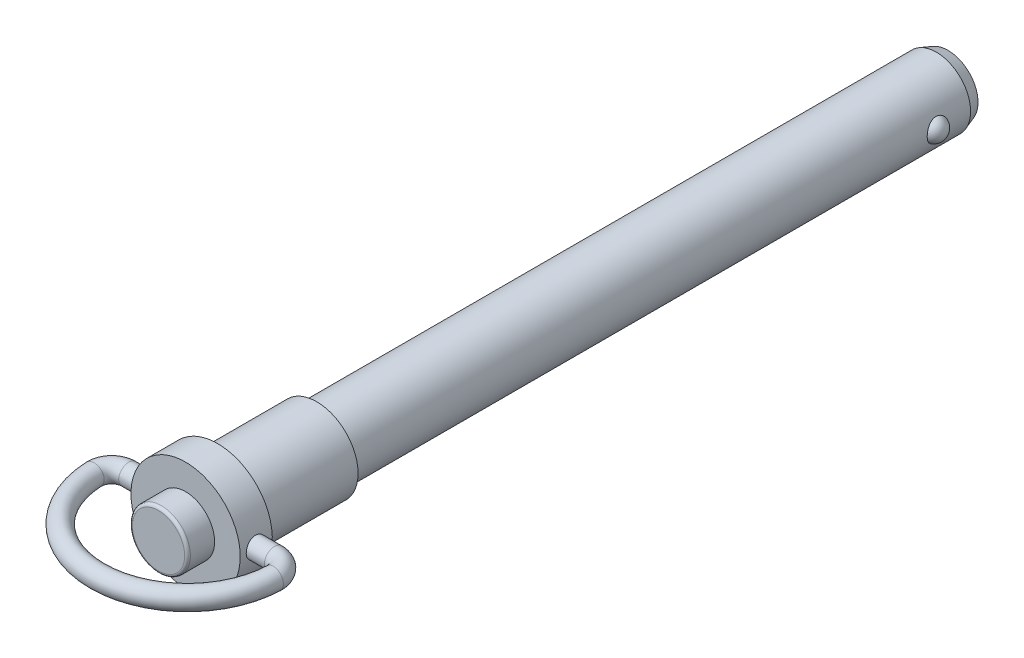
ISO-10303-21;
HEADER;
FILE_DESCRIPTION(('STEP AP214'),'2;1');
FILE_NAME('part.step','',(''),(''),'','','');
FILE_SCHEMA(('AUTOMOTIVE_DESIGN { 1 0 10303 214 1 1 1 1 }'));
ENDSEC;
DATA;
#1=APPLICATION_CONTEXT('core data for automotive mechanical design processes');
#2=APPLICATION_PROTOCOL_DEFINITION('international standard','automotive_design',2000,#1);
#3=PRODUCT_CONTEXT('',#1,'mechanical');
#4=PRODUCT('Part','Part','',(#3));
#5=PRODUCT_RELATED_PRODUCT_CATEGORY('part','',(#4));
#6=PRODUCT_DEFINITION_FORMATION('','',#4);
#7=PRODUCT_DEFINITION_CONTEXT('part definition',#1,'design');
#8=PRODUCT_DEFINITION('design','',#6,#7);
#9=PRODUCT_DEFINITION_SHAPE('','',#8);
#10=(LENGTH_UNIT() NAMED_UNIT(*) SI_UNIT(.MILLI.,.METRE.));
#11=(NAMED_UNIT(*) PLANE_ANGLE_UNIT() SI_UNIT($,.RADIAN.));
#12=(NAMED_UNIT(*) SI_UNIT($,.STERADIAN.) SOLID_ANGLE_UNIT());
#13=UNCERTAINTY_MEASURE_WITH_UNIT(LENGTH_MEASURE(1.E-05),#10,'distance_accuracy_value','');
#14=(GEOMETRIC_REPRESENTATION_CONTEXT(3) GLOBAL_UNCERTAINTY_ASSIGNED_CONTEXT((#13)) GLOBAL_UNIT_ASSIGNED_CONTEXT((#10,
#11,#12)) REPRESENTATION_CONTEXT('',''));
#15=CARTESIAN_POINT('',(0.,0.,0.));
#16=DIRECTION('',(0.,0.,1.));
#17=DIRECTION('',(1.,0.,0.));
#18=AXIS2_PLACEMENT_3D('',#15,#16,#17);
#19=CARTESIAN_POINT('',(-5.23004748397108,0.,-110.0304));
#20=DIRECTION('',(0.,0.,1.));
#21=DIRECTION('',(0.,1.,0.));
#22=AXIS2_PLACEMENT_3D('',#19,#20,#21);
#23=PLANE('',#22);
#24=CARTESIAN_POINT('',(0.,0.,-110.030399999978));
#25=DIRECTION('',(0.,0.,1.));
#26=DIRECTION('',(0.,1.,0.));
#27=AXIS2_PLACEMENT_3D('',#24,#25,#26);
#28=CIRCLE('',#27,5.23004748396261);
#29=CARTESIAN_POINT('',(0.,5.23004748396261,-110.030399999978));
#30=VERTEX_POINT('',#29);
#31=EDGE_CURVE('E117',#30,#30,#28,.T.);
#32=ORIENTED_EDGE('',*,*,#31,.F.);
#33=EDGE_LOOP('',(#32));
#34=FACE_BOUND('',#33,.T.);
#35=ADVANCED_FACE('F12',(#34),#23,.F.);
#36=CARTESIAN_POINT('',(-5.24129,0.,-102.2834));
#37=DIRECTION('',(0.,0.,1.));
#38=DIRECTION('',(-1.,0.,0.));
#39=AXIS2_PLACEMENT_3D('',#36,#37,#38);
#40=SPHERICAL_SURFACE('',#39,1.98374);
#41=CARTESIAN_POINT('',(-5.969635,0.,-100.43820679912));
#42=CARTESIAN_POINT('',(-5.96963006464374,-0.111015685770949,-100.438211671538));
#43=CARTESIAN_POINT('',(-5.96650644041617,-0.222143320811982,-100.447027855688));
#44=CARTESIAN_POINT('',(-5.95431160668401,-0.441381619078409,-100.482176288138));
#45=CARTESIAN_POINT('',(-5.94523092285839,-0.549487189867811,-100.508536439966));
#46=CARTESIAN_POINT('',(-5.92206953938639,-0.759461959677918,-100.578306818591));
#47=CARTESIAN_POINT('',(-5.90799052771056,-0.861333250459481,-100.621711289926));
#48=CARTESIAN_POINT('',(-5.87633956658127,-1.05588670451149,-100.724745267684));
#49=CARTESIAN_POINT('',(-5.85876868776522,-1.14857167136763,-100.784369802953));
#50=CARTESIAN_POINT('',(-5.82223010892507,-1.32133430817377,-100.91812310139));
#51=CARTESIAN_POINT('',(-5.80327429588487,-1.40150415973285,-100.992135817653));
#52=CARTESIAN_POINT('',(-5.76604946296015,-1.54754922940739,-101.153307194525));
#53=CARTESIAN_POINT('',(-5.74778035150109,-1.61342635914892,-101.240464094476));
#54=CARTESIAN_POINT('',(-5.71483308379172,-1.72643370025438,-101.422186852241));
#55=CARTESIAN_POINT('',(-5.70004608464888,-1.77417349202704,-101.516353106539));
#56=CARTESIAN_POINT('',(-5.67505831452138,-1.85255616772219,-101.712115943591));
#57=CARTESIAN_POINT('',(-5.66485545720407,-1.88320683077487,-101.813709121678));
#58=CARTESIAN_POINT('',(-5.65080765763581,-1.92493419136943,-102.014868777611));
#59=CARTESIAN_POINT('',(-5.64661793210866,-1.9370751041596,-102.11419104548));
#60=CARTESIAN_POINT('',(-5.64397531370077,-1.94476367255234,-102.313541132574));
#61=CARTESIAN_POINT('',(-5.64552102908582,-1.94031535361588,-102.413568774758));
#62=CARTESIAN_POINT('',(-5.65399944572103,-1.9154603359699,-102.607667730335));
#63=CARTESIAN_POINT('',(-5.66073469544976,-1.89563839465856,-102.701823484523));
#64=CARTESIAN_POINT('',(-5.67860059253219,-1.84142507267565,-102.885380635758));
#65=CARTESIAN_POINT('',(-5.68973152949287,-1.80703273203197,-102.974781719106));
#66=CARTESIAN_POINT('',(-5.71546454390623,-1.72392617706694,-103.148298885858));
#67=CARTESIAN_POINT('',(-5.730129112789,-1.67494987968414,-103.232280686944));
#68=CARTESIAN_POINT('',(-5.75347973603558,-1.5921163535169,-103.351322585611));
#69=CARTESIAN_POINT('',(-5.76149126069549,-1.5629344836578,-103.38985758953));
#70=CARTESIAN_POINT('',(-5.77777807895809,-1.50160973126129,-103.464489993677));
#71=CARTESIAN_POINT('',(-5.78605358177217,-1.46946445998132,-103.500585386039));
#72=CARTESIAN_POINT('',(-5.81187985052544,-1.36524181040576,-103.608706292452));
#73=CARTESIAN_POINT('',(-5.82954302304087,-1.28840068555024,-103.676204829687));
#74=CARTESIAN_POINT('',(-5.8633393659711,-1.12462015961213,-103.798067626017));
#75=CARTESIAN_POINT('',(-5.87947206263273,-1.03767765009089,-103.852427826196));
#76=CARTESIAN_POINT('',(-5.90173079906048,-0.899149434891,-103.924600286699));
#77=CARTESIAN_POINT('',(-5.90897547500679,-0.850337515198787,-103.947523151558));
#78=CARTESIAN_POINT('',(-5.92242841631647,-0.750927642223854,-103.989369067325));
#79=CARTESIAN_POINT('',(-5.92863755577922,-0.700331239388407,-104.008295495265));
#80=CARTESIAN_POINT('',(-5.939859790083,-0.597720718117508,-104.042064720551));
#81=CARTESIAN_POINT('',(-5.9448739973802,-0.54570796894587,-104.05691131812));
#82=CARTESIAN_POINT('',(-5.95358843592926,-0.440577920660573,-104.08248082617));
#83=CARTESIAN_POINT('',(-5.95728882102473,-0.38746075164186,-104.093204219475));
#84=CARTESIAN_POINT('',(-5.96337469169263,-0.278836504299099,-104.11074630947));
#85=CARTESIAN_POINT('',(-5.96571659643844,-0.223305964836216,-104.117435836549));
#86=CARTESIAN_POINT('',(-5.96884799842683,-0.111859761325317,-104.126360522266));
#87=CARTESIAN_POINT('',(-5.96963748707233,-0.0559440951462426,-104.128595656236));
#88=CARTESIAN_POINT('',(-5.96963006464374,0.11101568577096,-104.128588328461));
#89=CARTESIAN_POINT('',(-5.96650644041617,0.222143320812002,-104.119772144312));
#90=CARTESIAN_POINT('',(-5.95431160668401,0.441381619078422,-104.084623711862));
#91=CARTESIAN_POINT('',(-5.94523092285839,0.54948718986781,-104.058263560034));
#92=CARTESIAN_POINT('',(-5.9220695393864,0.759461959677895,-103.988493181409));
#93=CARTESIAN_POINT('',(-5.90799052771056,0.861333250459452,-103.945088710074));
#94=CARTESIAN_POINT('',(-5.87633956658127,1.05588670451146,-103.842054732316));
#95=CARTESIAN_POINT('',(-5.85876868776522,1.1485716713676,-103.782430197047));
#96=CARTESIAN_POINT('',(-5.82223010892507,1.32133430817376,-103.64867689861));
#97=CARTESIAN_POINT('',(-5.80327429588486,1.40150415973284,-103.574664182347));
#98=CARTESIAN_POINT('',(-5.76604946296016,1.54754922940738,-103.413492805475));
#99=CARTESIAN_POINT('',(-5.7477803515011,1.61342635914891,-103.326335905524));
#100=CARTESIAN_POINT('',(-5.71483308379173,1.72643370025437,-103.144613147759));
#101=CARTESIAN_POINT('',(-5.70004608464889,1.77417349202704,-103.050446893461));
#102=CARTESIAN_POINT('',(-5.67505831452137,1.85255616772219,-102.854684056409));
#103=CARTESIAN_POINT('',(-5.66485545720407,1.88320683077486,-102.753090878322));
#104=CARTESIAN_POINT('',(-5.65080765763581,1.92493419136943,-102.551931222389));
#105=CARTESIAN_POINT('',(-5.64661793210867,1.9370751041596,-102.45260895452));
#106=CARTESIAN_POINT('',(-5.64397531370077,1.94476367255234,-102.253258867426));
#107=CARTESIAN_POINT('',(-5.64552102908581,1.94031535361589,-102.153231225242));
#108=CARTESIAN_POINT('',(-5.65399944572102,1.91546033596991,-101.959132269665));
#109=CARTESIAN_POINT('',(-5.66073469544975,1.89563839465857,-101.864976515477));
#110=CARTESIAN_POINT('',(-5.67860059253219,1.84142507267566,-101.681419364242));
#111=CARTESIAN_POINT('',(-5.68973152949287,1.80703273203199,-101.592018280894));
#112=CARTESIAN_POINT('',(-5.71546454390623,1.72392617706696,-101.418501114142));
#113=CARTESIAN_POINT('',(-5.730129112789,1.67494987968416,-101.334519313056));
#114=CARTESIAN_POINT('',(-5.75347973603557,1.59211635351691,-101.215477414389));
#115=CARTESIAN_POINT('',(-5.76149126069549,1.56293448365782,-101.17694241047));
#116=CARTESIAN_POINT('',(-5.77777807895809,1.50160973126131,-101.102310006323));
#117=CARTESIAN_POINT('',(-5.78605358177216,1.46946445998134,-101.066214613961));
#118=CARTESIAN_POINT('',(-5.81187985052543,1.36524181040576,-100.958093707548));
#119=CARTESIAN_POINT('',(-5.82954302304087,1.28840068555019,-100.890595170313));
#120=CARTESIAN_POINT('',(-5.86333936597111,1.12462015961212,-100.768732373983));
#121=CARTESIAN_POINT('',(-5.87947206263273,1.03767765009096,-100.714372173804));
#122=CARTESIAN_POINT('',(-5.90173079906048,0.899149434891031,-100.642199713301));
#123=CARTESIAN_POINT('',(-5.9089754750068,0.850337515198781,-100.619276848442));
#124=CARTESIAN_POINT('',(-5.92242841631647,0.750927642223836,-100.577430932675));
#125=CARTESIAN_POINT('',(-5.92863755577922,0.700331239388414,-100.558504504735));
#126=CARTESIAN_POINT('',(-5.939859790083,0.597720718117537,-100.524735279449));
#127=CARTESIAN_POINT('',(-5.9448739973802,0.545707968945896,-100.50988868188));
#128=CARTESIAN_POINT('',(-5.95358843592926,0.440577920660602,-100.48431917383));
#129=CARTESIAN_POINT('',(-5.95728882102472,0.387460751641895,-100.473595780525));
#130=CARTESIAN_POINT('',(-5.96337469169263,0.278836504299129,-100.45605369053));
#131=CARTESIAN_POINT('',(-5.96571659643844,0.223305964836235,-100.449364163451));
#132=CARTESIAN_POINT('',(-5.96884799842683,0.111859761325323,-100.440439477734));
#133=CARTESIAN_POINT('',(-5.96963748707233,0.0559440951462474,-100.438204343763));
#134=CARTESIAN_POINT('',(-5.969635,0.,-100.43820679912));
#135=B_SPLINE_CURVE_WITH_KNOTS('',3,(#41,#42,#43,#44,#45,#46,#47,#48,#49,#50,#51,#52,#53,#54,
#55,#56,#57,#58,#59,#60,#61,#62,#63,#64,#65,#66,#67,#68,#69,#70,#71,#72,#73,#74,#75,#76,#77,#78,
#79,#80,#81,#82,#83,#84,#85,#86,#87,#88,#89,#90,#91,#92,#93,#94,#95,#96,#97,#98,#99,#100,#101,
#102,#103,#104,#105,#106,#107,#108,#109,#110,#111,#112,#113,#114,#115,#116,#117,#118,#119,#120,
#121,#122,#123,#124,#125,#126,#127,#128,#129,#130,#131,#132,#133,#134),.UNSPECIFIED.,.T.,.F.,(4,
2,2,2,2,2,2,2,2,2,2,2,2,2,2,2,2,2,2,2,2,2,2,2,2,2,2,2,2,2,2,2,2,2,2,2,2,2,2,2,2,2,2,2,2,2,4),
(0.,0.332850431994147,0.666231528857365,0.999500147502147,1.332666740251,1.66325004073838,
1.99378909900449,2.31195183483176,2.62996962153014,2.92890394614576,3.22776573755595,
3.51578606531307,3.80382537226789,4.09739019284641,4.24425224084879,4.39123372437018,
4.70115251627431,5.01116693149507,5.174240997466,5.33717670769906,5.49996013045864,
5.66272448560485,5.83045675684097,5.99818995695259,6.33104038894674,6.66442148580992,
6.99769010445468,7.33085669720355,7.66143999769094,7.99197905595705,8.31014179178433,
8.62815957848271,8.92709390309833,9.22595569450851,9.51397602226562,9.80201532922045,
10.095580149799,10.2424421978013,10.3894236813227,10.6993424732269,11.0093568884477,
11.1724309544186,11.3353666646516,11.4981500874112,11.6609144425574,11.8286467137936,
11.9963799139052),.UNSPECIFIED.);
#136=CARTESIAN_POINT('',(-5.969635,0.,-100.43820679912));
#137=VERTEX_POINT('',#136);
#138=EDGE_CURVE('E30',#137,#137,#135,.T.);
#139=ORIENTED_EDGE('',*,*,#138,.F.);
#140=EDGE_LOOP('',(#139));
#141=FACE_BOUND('',#140,.T.);
#142=ADVANCED_FACE('F103',(#141),#40,.T.);
#143=CARTESIAN_POINT('',(5.24123,0.,-102.2834));
#144=DIRECTION('',(0.,0.,1.));
#145=DIRECTION('',(-1.,0.,0.));
#146=AXIS2_PLACEMENT_3D('',#143,#144,#145);
#147=SPHERICAL_SURFACE('',#146,1.98374);
#148=CARTESIAN_POINT('',(5.969635,0.,-104.128569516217));
#149=CARTESIAN_POINT('',(5.96963006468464,-0.111015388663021,-104.128564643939));
#150=CARTESIAN_POINT('',(5.96650645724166,-0.222142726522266,-104.119748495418));
#151=CARTESIAN_POINT('',(5.95431168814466,-0.441380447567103,-104.084600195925));
#152=CARTESIAN_POINT('',(5.94523105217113,-0.549485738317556,-104.058240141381));
#153=CARTESIAN_POINT('',(5.92206978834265,-0.759459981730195,-103.988469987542));
#154=CARTESIAN_POINT('',(5.90799084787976,-0.86133102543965,-103.945065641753));
#155=CARTESIAN_POINT('',(5.87634005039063,-1.05588398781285,-103.842031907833));
#156=CARTESIAN_POINT('',(5.85876926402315,-1.14856871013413,-103.782407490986));
#157=CARTESIAN_POINT('',(5.82223094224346,-1.32133060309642,-103.648654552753));
#158=CARTESIAN_POINT('',(5.8032752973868,-1.40149998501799,-103.574642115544));
#159=CARTESIAN_POINT('',(5.76605083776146,-1.54754408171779,-103.413471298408));
#160=CARTESIAN_POINT('',(5.74778193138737,-1.61342070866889,-103.326314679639));
#161=CARTESIAN_POINT('',(5.71483520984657,-1.72642663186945,-103.144593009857));
#162=CARTESIAN_POINT('',(5.70004853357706,-1.77416560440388,-103.050427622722));
#163=CARTESIAN_POINT('',(5.67506139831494,-1.85254670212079,-102.854666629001));
#164=CARTESIAN_POINT('',(5.66485885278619,-1.88319660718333,-102.753074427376));
#165=CARTESIAN_POINT('',(5.65081166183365,-1.92492242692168,-102.551917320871));
#166=CARTESIAN_POINT('',(5.64662220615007,-1.9370626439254,-102.452596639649));
#167=CARTESIAN_POINT('',(5.64398000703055,-1.94475005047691,-102.253249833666));
#168=CARTESIAN_POINT('',(5.64552587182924,-1.94030126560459,-102.153223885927));
#169=CARTESIAN_POINT('',(5.65400443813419,-1.91544560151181,-101.959128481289));
#170=CARTESIAN_POINT('',(5.66073968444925,-1.8956234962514,-101.864974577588));
#171=CARTESIAN_POINT('',(5.67860543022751,-1.84141015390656,-101.681421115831));
#172=CARTESIAN_POINT('',(5.68973621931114,-1.80701795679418,-101.592021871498));
#173=CARTESIAN_POINT('',(5.71546883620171,-1.72391193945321,-101.418508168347));
#174=CARTESIAN_POINT('',(5.73013315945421,-1.67493601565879,-101.334528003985));
#175=CARTESIAN_POINT('',(5.75348335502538,-1.59210327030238,-101.215488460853));
#176=CARTESIAN_POINT('',(5.76149472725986,-1.56292169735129,-101.176954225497));
#177=CARTESIAN_POINT('',(5.77778122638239,-1.50159761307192,-101.102323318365));
#178=CARTESIAN_POINT('',(5.78605656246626,-1.46945271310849,-101.066228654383));
#179=CARTESIAN_POINT('',(5.81188236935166,-1.3652310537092,-100.958109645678));
#180=CARTESIAN_POINT('',(5.82954523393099,-1.28839062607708,-100.890612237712));
#181=CARTESIAN_POINT('',(5.86334097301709,-1.12461171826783,-100.768751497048));
#182=CARTESIAN_POINT('',(5.87947337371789,-1.03767012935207,-100.714392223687));
#183=CARTESIAN_POINT('',(5.90173174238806,-0.89914322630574,-100.642220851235));
#184=CARTESIAN_POINT('',(5.90897632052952,-0.850331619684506,-100.619298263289));
#185=CARTESIAN_POINT('',(5.92242907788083,-0.750922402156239,-100.577452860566));
#186=CARTESIAN_POINT('',(5.92863813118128,-0.700326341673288,-100.558526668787));
#187=CARTESIAN_POINT('',(5.93986020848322,-0.597716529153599,-100.52475786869));
#188=CARTESIAN_POINT('',(5.94487434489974,-0.545704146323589,-100.509911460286));
#189=CARTESIAN_POINT('',(5.95358865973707,-0.440574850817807,-100.484342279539));
#190=CARTESIAN_POINT('',(5.95728899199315,-0.38745806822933,-100.473619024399));
#191=CARTESIAN_POINT('',(5.96337477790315,-0.278834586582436,-100.456077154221));
#192=CARTESIAN_POINT('',(5.96571665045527,-0.223304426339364,-100.449387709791));
#193=CARTESIAN_POINT('',(5.96884800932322,-0.111858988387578,-100.4404631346));
#194=CARTESIAN_POINT('',(5.96963748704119,-0.0559437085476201,-100.438228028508));
#195=CARTESIAN_POINT('',(5.96963006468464,0.111015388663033,-100.438235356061));
#196=CARTESIAN_POINT('',(5.96650645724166,0.222142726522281,-100.447051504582));
#197=CARTESIAN_POINT('',(5.95431168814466,0.441380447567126,-100.482199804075));
#198=CARTESIAN_POINT('',(5.94523105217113,0.549485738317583,-100.508559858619));
#199=CARTESIAN_POINT('',(5.92206978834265,0.759459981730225,-100.578330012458));
#200=CARTESIAN_POINT('',(5.90799084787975,0.861331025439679,-100.621734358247));
#201=CARTESIAN_POINT('',(5.87634005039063,1.05588398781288,-100.724768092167));
#202=CARTESIAN_POINT('',(5.85876926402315,1.14856871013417,-100.784392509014));
#203=CARTESIAN_POINT('',(5.82223094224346,1.32133060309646,-100.918145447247));
#204=CARTESIAN_POINT('',(5.8032752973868,1.40149998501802,-100.992157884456));
#205=CARTESIAN_POINT('',(5.76605083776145,1.54754408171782,-101.153328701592));
#206=CARTESIAN_POINT('',(5.74778193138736,1.61342070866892,-101.240485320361));
#207=CARTESIAN_POINT('',(5.71483520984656,1.7264266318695,-101.422206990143));
#208=CARTESIAN_POINT('',(5.70004853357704,1.77416560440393,-101.516372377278));
#209=CARTESIAN_POINT('',(5.67506139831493,1.85254670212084,-101.712133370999));
#210=CARTESIAN_POINT('',(5.66485885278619,1.88319660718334,-101.813725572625));
#211=CARTESIAN_POINT('',(5.65081166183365,1.92492242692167,-102.01488267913));
#212=CARTESIAN_POINT('',(5.64662220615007,1.93706264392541,-102.114203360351));
#213=CARTESIAN_POINT('',(5.64398000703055,1.94475005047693,-102.313550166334));
#214=CARTESIAN_POINT('',(5.64552587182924,1.94030126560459,-102.413576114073));
#215=CARTESIAN_POINT('',(5.65400443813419,1.91544560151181,-102.607671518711));
#216=CARTESIAN_POINT('',(5.66073968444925,1.89562349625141,-102.701825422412));
#217=CARTESIAN_POINT('',(5.67860543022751,1.84141015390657,-102.885378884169));
#218=CARTESIAN_POINT('',(5.68973621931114,1.80701795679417,-102.974778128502));
#219=CARTESIAN_POINT('',(5.71546883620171,1.7239119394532,-103.148291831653));
#220=CARTESIAN_POINT('',(5.73013315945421,1.67493601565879,-103.232271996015));
#221=CARTESIAN_POINT('',(5.75348335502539,1.59210327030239,-103.351311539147));
#222=CARTESIAN_POINT('',(5.76149472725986,1.56292169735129,-103.389845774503));
#223=CARTESIAN_POINT('',(5.77778122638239,1.50159761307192,-103.464476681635));
#224=CARTESIAN_POINT('',(5.78605656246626,1.46945271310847,-103.500571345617));
#225=CARTESIAN_POINT('',(5.81188236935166,1.36523105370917,-103.608690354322));
#226=CARTESIAN_POINT('',(5.82954523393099,1.28839062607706,-103.676187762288));
#227=CARTESIAN_POINT('',(5.8633409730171,1.12461171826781,-103.798048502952));
#228=CARTESIAN_POINT('',(5.8794733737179,1.03767012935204,-103.852407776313));
#229=CARTESIAN_POINT('',(5.90173174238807,0.899143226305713,-103.924579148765));
#230=CARTESIAN_POINT('',(5.90897632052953,0.850331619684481,-103.947501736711));
#231=CARTESIAN_POINT('',(5.92242907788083,0.750922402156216,-103.989347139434));
#232=CARTESIAN_POINT('',(5.92863813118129,0.700326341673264,-104.008273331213));
#233=CARTESIAN_POINT('',(5.93986020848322,0.597716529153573,-104.04204213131));
#234=CARTESIAN_POINT('',(5.94487434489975,0.545704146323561,-104.056888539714));
#235=CARTESIAN_POINT('',(5.95358865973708,0.440574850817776,-104.082457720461));
#236=CARTESIAN_POINT('',(5.95728899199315,0.387458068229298,-104.093180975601));
#237=CARTESIAN_POINT('',(5.96337477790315,0.278834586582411,-104.110722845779));
#238=CARTESIAN_POINT('',(5.96571665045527,0.223304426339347,-104.117412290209));
#239=CARTESIAN_POINT('',(5.96884800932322,0.111858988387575,-104.1263368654));
#240=CARTESIAN_POINT('',(5.96963748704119,0.0559437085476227,-104.128571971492));
#241=CARTESIAN_POINT('',(5.969635,0.,-104.128569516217));
#242=B_SPLINE_CURVE_WITH_KNOTS('',3,(#148,#149,#150,#151,#152,#153,#154,#155,#156,#157,#158,
#159,#160,#161,#162,#163,#164,#165,#166,#167,#168,#169,#170,#171,#172,#173,#174,#175,#176,#177,
#178,#179,#180,#181,#182,#183,#184,#185,#186,#187,#188,#189,#190,#191,#192,#193,#194,#195,#196,
#197,#198,#199,#200,#201,#202,#203,#204,#205,#206,#207,#208,#209,#210,#211,#212,#213,#214,#215,
#216,#217,#218,#219,#220,#221,#222,#223,#224,#225,#226,#227,#228,#229,#230,#231,#232,#233,#234,
#235,#236,#237,#238,#239,#240,#241),.UNSPECIFIED.,.T.,.F.,(4,2,2,2,2,2,2,2,2,2,2,2,2,2,2,2,2,2,
2,2,2,2,2,2,2,2,2,2,2,2,2,2,2,2,2,2,2,2,2,2,2,2,2,2,2,2,4),(0.,0.332849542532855,
0.666229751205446,0.99949751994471,1.33266326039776,1.66324488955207,1.9937822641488,
2.31194147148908,2.6299557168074,2.92888505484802,3.22774185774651,3.51575689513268,
3.80379091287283,4.09735090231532,4.244210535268,4.39118959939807,4.70110451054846,
5.01111505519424,5.1741878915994,5.33712237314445,5.49990457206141,5.66266770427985,
5.83039881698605,5.99813085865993,6.33098040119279,6.66436060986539,6.99762837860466,
7.33079411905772,7.66137574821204,7.99191312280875,8.31007233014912,8.62808657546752,
8.92701591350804,9.22587271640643,9.5138877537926,9.80192177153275,10.0954817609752,
10.2423413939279,10.389320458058,10.6992353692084,11.0092459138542,11.1723187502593,
11.3352532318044,11.4980354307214,11.6607985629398,11.828529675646,11.9962617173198),.UNSPECIFIED.);
#243=CARTESIAN_POINT('',(5.969635,0.,-104.128569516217));
#244=VERTEX_POINT('',#243);
#245=EDGE_CURVE('E8',#244,#244,#242,.T.);
#246=ORIENTED_EDGE('',*,*,#245,.F.);
#247=EDGE_LOOP('',(#246));
#248=FACE_BOUND('',#247,.T.);
#249=ADVANCED_FACE('F44',(#248),#147,.T.);
#250=CARTESIAN_POINT('',(0.,0.,-107.998400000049));
#251=DIRECTION('',(0.,0.,1.));
#252=DIRECTION('',(0.,1.,0.));
#253=AXIS2_PLACEMENT_3D('',#250,#251,#252);
#254=CONICAL_SURFACE('',#253,5.96963499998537,0.349065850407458);
#255=ORIENTED_EDGE('',*,*,#31,.T.);
#256=EDGE_LOOP('',(#255));
#257=FACE_BOUND('',#256,.T.);
#258=CARTESIAN_POINT('',(0.,0.,-107.9984));
#259=DIRECTION('',(0.,0.,1.));
#260=DIRECTION('',(0.,1.,0.));
#261=AXIS2_PLACEMENT_3D('',#258,#259,#260);
#262=CIRCLE('',#261,5.969635);
#263=CARTESIAN_POINT('',(0.,5.969635,-107.9984));
#264=VERTEX_POINT('',#263);
#265=EDGE_CURVE('E25',#264,#264,#262,.T.);
#266=ORIENTED_EDGE('',*,*,#265,.F.);
#267=EDGE_LOOP('',(#266));
#268=FACE_BOUND('',#267,.T.);
#269=ADVANCED_FACE('F54',(#257,#268),#254,.T.);
#270=CARTESIAN_POINT('',(0.,0.,-70.));
#271=DIRECTION('',(0.,0.,1.));
#272=DIRECTION('',(0.810321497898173,0.585985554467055,0.));
#273=AXIS2_PLACEMENT_3D('',#270,#271,#272);
#274=CYLINDRICAL_SURFACE('',#273,5.969635);
#275=CARTESIAN_POINT('',(0.,0.,0.));
#276=DIRECTION('',(0.,0.,-1.));
#277=DIRECTION('',(0.,1.,0.));
#278=AXIS2_PLACEMENT_3D('',#275,#276,#277);
#279=CIRCLE('',#278,5.969635);
#280=CARTESIAN_POINT('',(0.,5.969635,0.));
#281=VERTEX_POINT('',#280);
#282=EDGE_CURVE('E71',#281,#281,#279,.T.);
#283=ORIENTED_EDGE('',*,*,#282,.T.);
#284=EDGE_LOOP('',(#283));
#285=FACE_BOUND('',#284,.T.);
#286=ORIENTED_EDGE('',*,*,#265,.T.);
#287=EDGE_LOOP('',(#286));
#288=FACE_BOUND('',#287,.T.);
#289=ORIENTED_EDGE('',*,*,#245,.T.);
#290=EDGE_LOOP('',(#289));
#291=FACE_BOUND('',#290,.T.);
#292=ORIENTED_EDGE('',*,*,#138,.T.);
#293=EDGE_LOOP('',(#292));
#294=FACE_BOUND('',#293,.T.);
#295=ADVANCED_FACE('F49',(#285,#288,#291,#294),#274,.T.);
#296=CARTESIAN_POINT('',(0.,0.,27.575));
#297=DIRECTION('',(0.,0.,1.));
#298=DIRECTION('',(1.,0.,0.));
#299=AXIS2_PLACEMENT_3D('',#296,#297,#298);
#300=PLANE('',#299);
#301=CARTESIAN_POINT('',(0.,0.,27.575));
#302=DIRECTION('',(0.,0.,1.));
#303=DIRECTION('',(1.,0.,0.));
#304=AXIS2_PLACEMENT_3D('',#301,#302,#303);
#305=CIRCLE('',#304,4.5546);
#306=CARTESIAN_POINT('',(4.5546,0.,27.575));
#307=VERTEX_POINT('',#306);
#308=EDGE_CURVE('E135',#307,#307,#305,.T.);
#309=ORIENTED_EDGE('',*,*,#308,.T.);
#310=EDGE_LOOP('',(#309));
#311=FACE_BOUND('',#310,.T.);
#312=ADVANCED_FACE('F53',(#311),#300,.T.);
#313=CARTESIAN_POINT('',(0.,0.,22.5357550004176));
#314=DIRECTION('',(0.,1.,0.));
#315=DIRECTION('',(0.,0.,1.));
#316=AXIS2_PLACEMENT_3D('',#313,#314,#315);
#317=TOROIDAL_SURFACE('',#316,15.6980038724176,1.75);
#318=CARTESIAN_POINT('',(-15.6851704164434,0.,23.1703844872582));
#319=DIRECTION('',(-0.0404274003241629,0.,-0.999182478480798));
#320=DIRECTION('',(-0.999182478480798,0.,0.0404274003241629));
#321=AXIS2_PLACEMENT_3D('',#318,#319,#320);
#322=CIRCLE('',#321,1.75);
#323=CARTESIAN_POINT('',(-17.4337397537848,0.,23.2411324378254));
#324=VERTEX_POINT('',#323);
#325=EDGE_CURVE('E126',#324,#324,#322,.T.);
#326=CARTESIAN_POINT('',(15.6851704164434,0.,23.1703844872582));
#327=DIRECTION('',(-0.0404274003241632,0.,0.999182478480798));
#328=DIRECTION('',(0.999182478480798,0.,0.0404274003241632));
#329=AXIS2_PLACEMENT_3D('',#326,#327,#328);
#330=CIRCLE('',#329,1.75);
#331=CARTESIAN_POINT('',(17.4337397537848,0.,23.2411324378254));
#332=VERTEX_POINT('',#331);
#333=EDGE_CURVE('E129',#332,#332,#330,.T.);
#334=CARTESIAN_POINT('',(0.,0.,22.5357550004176));
#335=DIRECTION('',(0.,1.,0.));
#336=DIRECTION('',(0.,0.,1.));
#337=AXIS2_PLACEMENT_3D('',#334,#335,#336);
#338=CIRCLE('',#337,17.4480038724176);
#339=EDGE_CURVE('',#324,#332,#338,.T.);
#340=ORIENTED_EDGE('',*,*,#325,.F.);
#341=ORIENTED_EDGE('',*,*,#333,.T.);
#342=ORIENTED_EDGE('',*,*,#339,.T.);
#343=ORIENTED_EDGE('',*,*,#339,.F.);
#344=EDGE_LOOP('',(#340,#342,#341,#343));
#345=FACE_BOUND('',#344,.T.);
#346=ADVANCED_FACE('F167',(#345),#317,.T.);
#347=CARTESIAN_POINT('',(0.,0.,27.075));
#348=DIRECTION('',(0.,0.,1.));
#349=DIRECTION('',(1.,0.,0.));
#350=AXIS2_PLACEMENT_3D('',#347,#348,#349);
#351=TOROIDAL_SURFACE('',#350,4.5546,0.5);
#352=CARTESIAN_POINT('',(0.,0.,27.075));
#353=DIRECTION('',(0.,0.,1.));
#354=DIRECTION('',(1.,0.,0.));
#355=AXIS2_PLACEMENT_3D('',#352,#353,#354);
#356=CIRCLE('',#355,5.0546);
#357=CARTESIAN_POINT('',(5.0546,0.,27.075));
#358=VERTEX_POINT('',#357);
#359=EDGE_CURVE('E138',#358,#358,#356,.T.);
#360=ORIENTED_EDGE('',*,*,#359,.T.);
#361=EDGE_LOOP('',(#360));
#362=FACE_BOUND('',#361,.T.);
#363=ORIENTED_EDGE('',*,*,#308,.F.);
#364=EDGE_LOOP('',(#363));
#365=FACE_BOUND('',#364,.T.);
#366=ADVANCED_FACE('F94',(#362,#365),#351,.T.);
#367=CARTESIAN_POINT('',(12.7038508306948,0.,23.0497588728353));
#368=DIRECTION('',(0.,1.,0.));
#369=DIRECTION('',(0.,0.,1.));
#370=AXIS2_PLACEMENT_3D('',#367,#368,#369);
#371=TOROIDAL_SURFACE('',#370,2.98375887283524,1.75);
#372=CARTESIAN_POINT('',(12.7038508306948,0.,20.066));
#373=DIRECTION('',(1.,0.,0.));
#374=DIRECTION('',(0.,0.,-1.));
#375=AXIS2_PLACEMENT_3D('',#372,#373,#374);
#376=CIRCLE('',#375,1.75);
#377=CARTESIAN_POINT('',(12.7038508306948,0.,18.316));
#378=VERTEX_POINT('',#377);
#379=EDGE_CURVE('E132',#378,#378,#376,.T.);
#380=CARTESIAN_POINT('',(12.7038508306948,0.,23.0497588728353));
#381=DIRECTION('',(0.,1.,0.));
#382=DIRECTION('',(0.,0.,1.));
#383=AXIS2_PLACEMENT_3D('',#380,#381,#382);
#384=CIRCLE('',#383,4.73375887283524);
#385=EDGE_CURVE('',#332,#378,#384,.T.);
#386=ORIENTED_EDGE('',*,*,#333,.F.);
#387=ORIENTED_EDGE('',*,*,#379,.T.);
#388=ORIENTED_EDGE('',*,*,#385,.T.);
#389=ORIENTED_EDGE('',*,*,#385,.F.);
#390=EDGE_LOOP('',(#386,#388,#387,#389));
#391=FACE_BOUND('',#390,.T.);
#392=ADVANCED_FACE('F165',(#391),#371,.T.);
#393=CARTESIAN_POINT('',(-12.7038508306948,0.,23.0497588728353));
#394=DIRECTION('',(0.,1.,0.));
#395=DIRECTION('',(0.,0.,1.));
#396=AXIS2_PLACEMENT_3D('',#393,#394,#395);
#397=TOROIDAL_SURFACE('',#396,2.98375887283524,1.75);
#398=CARTESIAN_POINT('',(-12.7038508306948,0.,20.066));
#399=DIRECTION('',(1.,0.,0.));
#400=DIRECTION('',(0.,0.,-1.));
#401=AXIS2_PLACEMENT_3D('',#398,#399,#400);
#402=CIRCLE('',#401,1.75);
#403=CARTESIAN_POINT('',(-12.7038508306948,0.,18.316));
#404=VERTEX_POINT('',#403);
#405=EDGE_CURVE('E123',#404,#404,#402,.T.);
#406=CARTESIAN_POINT('',(-12.7038508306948,0.,23.0497588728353));
#407=DIRECTION('',(0.,1.,0.));
#408=DIRECTION('',(0.,0.,1.));
#409=AXIS2_PLACEMENT_3D('',#406,#407,#408);
#410=CIRCLE('',#409,4.73375887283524);
#411=EDGE_CURVE('',#404,#324,#410,.T.);
#412=ORIENTED_EDGE('',*,*,#405,.F.);
#413=ORIENTED_EDGE('',*,*,#325,.T.);
#414=ORIENTED_EDGE('',*,*,#411,.T.);
#415=ORIENTED_EDGE('',*,*,#411,.F.);
#416=EDGE_LOOP('',(#412,#414,#413,#415));
#417=FACE_BOUND('',#416,.T.);
#418=ADVANCED_FACE('F63',(#417),#397,.T.);
#419=CARTESIAN_POINT('',(0.,0.,28.575));
#420=DIRECTION('',(0.,0.,-1.));
#421=DIRECTION('',(0.,-1.,0.));
#422=AXIS2_PLACEMENT_3D('',#419,#420,#421);
#423=CYLINDRICAL_SURFACE('',#422,5.0546);
#424=ORIENTED_EDGE('',*,*,#359,.F.);
#425=EDGE_LOOP('',(#424));
#426=FACE_BOUND('',#425,.T.);
#427=CARTESIAN_POINT('',(0.,0.,22.86));
#428=DIRECTION('',(0.,0.,-1.));
#429=DIRECTION('',(0.,-1.,0.));
#430=AXIS2_PLACEMENT_3D('',#427,#428,#429);
#431=CIRCLE('',#430,5.0546);
#432=CARTESIAN_POINT('',(0.,-5.0546,22.86));
#433=VERTEX_POINT('',#432);
#434=EDGE_CURVE('E73',#433,#433,#431,.T.);
#435=ORIENTED_EDGE('',*,*,#434,.F.);
#436=EDGE_LOOP('',(#435));
#437=FACE_BOUND('',#436,.T.);
#438=ADVANCED_FACE('F81',(#426,#437),#423,.T.);
#439=CARTESIAN_POINT('',(12.7038508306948,0.,20.066));
#440=DIRECTION('',(-1.,0.,0.));
#441=DIRECTION('',(0.,0.,1.));
#442=AXIS2_PLACEMENT_3D('',#439,#440,#441);
#443=CYLINDRICAL_SURFACE('',#442,1.75);
#444=CARTESIAN_POINT('',(9.525,0.,21.816));
#445=CARTESIAN_POINT('',(9.52499824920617,0.0974196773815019,21.8159962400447));
#446=CARTESIAN_POINT('',(9.52348996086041,0.194888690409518,21.8078377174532));
#447=CARTESIAN_POINT('',(9.51761845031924,0.387082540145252,21.7754387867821));
#448=CARTESIAN_POINT('',(9.5132527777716,0.481804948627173,21.7511845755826));
#449=CARTESIAN_POINT('',(9.50215510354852,0.66569803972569,21.6873599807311));
#450=CARTESIAN_POINT('',(9.49542520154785,0.75487356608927,21.6478031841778));
#451=CARTESIAN_POINT('',(9.48033492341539,0.925313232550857,21.5545343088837));
#452=CARTESIAN_POINT('',(9.4719746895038,1.00657806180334,21.5008234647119));
#453=CARTESIAN_POINT('',(9.45443959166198,1.15983447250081,21.38011409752));
#454=CARTESIAN_POINT('',(9.44525721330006,1.23172173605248,21.3129842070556));
#455=CARTESIAN_POINT('',(9.42716883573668,1.36328019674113,21.1676249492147));
#456=CARTESIAN_POINT('',(9.41826285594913,1.42295053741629,21.0893948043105));
#457=CARTESIAN_POINT('',(9.40166266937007,1.52881224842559,20.9233223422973));
#458=CARTESIAN_POINT('',(9.39397815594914,1.57489805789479,20.8354116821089));
#459=CARTESIAN_POINT('',(9.3807965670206,1.65160688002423,20.6529311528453));
#460=CARTESIAN_POINT('',(9.3752993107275,1.68223117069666,20.5583618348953));
#461=CARTESIAN_POINT('',(9.36719014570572,1.72681399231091,20.3663627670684));
#462=CARTESIAN_POINT('',(9.36454682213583,1.74095411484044,20.2689765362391));
#463=CARTESIAN_POINT('',(9.36235004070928,1.75273074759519,20.0731807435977));
#464=CARTESIAN_POINT('',(9.3627963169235,1.75036867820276,19.9747712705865));
#465=CARTESIAN_POINT('',(9.36669969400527,1.72935535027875,19.7810343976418));
#466=CARTESIAN_POINT('',(9.37011871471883,1.71091010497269,19.6856837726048));
#467=CARTESIAN_POINT('',(9.37952256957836,1.65857824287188,19.49945389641));
#468=CARTESIAN_POINT('',(9.38550750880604,1.62469099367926,19.4085748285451));
#469=CARTESIAN_POINT('',(9.39940890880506,1.54223419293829,19.2332623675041));
#470=CARTESIAN_POINT('',(9.40733632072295,1.49358101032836,19.1488692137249));
#471=CARTESIAN_POINT('',(9.42422213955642,1.38303261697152,18.98936699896));
#472=CARTESIAN_POINT('',(9.43318064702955,1.32113611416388,18.9142588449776));
#473=CARTESIAN_POINT('',(9.45128545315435,1.184745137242,18.77426795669));
#474=CARTESIAN_POINT('',(9.46043254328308,1.11007434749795,18.7095569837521));
#475=CARTESIAN_POINT('',(9.47775926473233,0.950845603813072,18.5935547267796));
#476=CARTESIAN_POINT('',(9.48593888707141,0.866287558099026,18.5422635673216));
#477=CARTESIAN_POINT('',(9.50042458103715,0.689508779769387,18.4545334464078));
#478=CARTESIAN_POINT('',(9.50672846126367,0.597279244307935,18.4181118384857));
#479=CARTESIAN_POINT('',(9.51673535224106,0.407869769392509,18.3613256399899));
#480=CARTESIAN_POINT('',(9.52043862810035,0.310690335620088,18.3409594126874));
#481=CARTESIAN_POINT('',(9.5247907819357,0.115617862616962,18.3170999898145));
#482=CARTESIAN_POINT('',(9.52548227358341,0.0177545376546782,18.313371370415));
#483=CARTESIAN_POINT('',(9.52385046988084,-0.17719740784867,18.3222622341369));
#484=CARTESIAN_POINT('',(9.52152731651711,-0.274286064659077,18.3348809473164));
#485=CARTESIAN_POINT('',(9.51415375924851,-0.46418965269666,18.3759125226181));
#486=CARTESIAN_POINT('',(9.50912384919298,-0.557031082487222,18.4042067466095));
#487=CARTESIAN_POINT('',(9.49689842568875,-0.736652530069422,18.4756581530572));
#488=CARTESIAN_POINT('',(9.48970276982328,-0.823432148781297,18.5188163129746));
#489=CARTESIAN_POINT('',(9.47383776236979,-0.98947475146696,18.6192949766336));
#490=CARTESIAN_POINT('',(9.46515367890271,-1.06864888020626,18.676759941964));
#491=CARTESIAN_POINT('',(9.44731421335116,-1.21631462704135,18.8040249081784));
#492=CARTESIAN_POINT('',(9.43815878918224,-1.28480528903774,18.873826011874));
#493=CARTESIAN_POINT('',(9.42026781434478,-1.41005035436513,19.0248458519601));
#494=CARTESIAN_POINT('',(9.41153908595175,-1.46664438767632,19.1061985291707));
#495=CARTESIAN_POINT('',(9.39562517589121,-1.56536359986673,19.277394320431));
#496=CARTESIAN_POINT('',(9.38843993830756,-1.60748930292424,19.3672371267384));
#497=CARTESIAN_POINT('',(9.3764796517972,-1.67584630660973,19.5524479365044));
#498=CARTESIAN_POINT('',(9.37169329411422,-1.70215230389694,19.6477876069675));
#499=CARTESIAN_POINT('',(9.36504636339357,-1.73835449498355,19.8416293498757));
#500=CARTESIAN_POINT('',(9.36318547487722,-1.7482524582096,19.9401310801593));
#501=CARTESIAN_POINT('',(9.3626157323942,-1.75130025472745,20.1358954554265));
#502=CARTESIAN_POINT('',(9.36385929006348,-1.74470294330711,20.2331541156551));
#503=CARTESIAN_POINT('',(9.36925303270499,-1.71549975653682,20.4251511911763));
#504=CARTESIAN_POINT('',(9.37340320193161,-1.69289396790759,20.5198896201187));
#505=CARTESIAN_POINT('',(9.38412287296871,-1.63242039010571,20.7040281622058));
#506=CARTESIAN_POINT('',(9.39068820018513,-1.5945789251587,20.7934371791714));
#507=CARTESIAN_POINT('',(9.40550157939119,-1.50473547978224,20.964677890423));
#508=CARTESIAN_POINT('',(9.41374974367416,-1.45273255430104,21.0465090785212));
#509=CARTESIAN_POINT('',(9.43114776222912,-1.33515884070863,21.2015399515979));
#510=CARTESIAN_POINT('',(9.44030888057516,-1.26940363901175,21.2745985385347));
#511=CARTESIAN_POINT('',(9.45841527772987,-1.12657740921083,21.4087295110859));
#512=CARTESIAN_POINT('',(9.4673605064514,-1.04950378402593,21.4697991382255));
#513=CARTESIAN_POINT('',(9.4841172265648,-0.885436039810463,21.5787070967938));
#514=CARTESIAN_POINT('',(9.49191831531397,-0.798362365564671,21.6264272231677));
#515=CARTESIAN_POINT('',(9.50540634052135,-0.617319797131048,21.7064857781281));
#516=CARTESIAN_POINT('',(9.51109528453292,-0.523357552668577,21.7388388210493));
#517=CARTESIAN_POINT('',(9.51854259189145,-0.357584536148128,21.7805891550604));
#518=CARTESIAN_POINT('',(9.52095058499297,-0.286749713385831,21.7938458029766));
#519=CARTESIAN_POINT('',(9.52417991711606,-0.143952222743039,21.8115525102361));
#520=CARTESIAN_POINT('',(9.52500129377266,-0.0719895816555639,21.8160027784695));
#521=CARTESIAN_POINT('',(9.525,0.,21.816));
#522=B_SPLINE_CURVE_WITH_KNOTS('',3,(#444,#445,#446,#447,#448,#449,#450,#451,#452,#453,#454,
#455,#456,#457,#458,#459,#460,#461,#462,#463,#464,#465,#466,#467,#468,#469,#470,#471,#472,#473,
#474,#475,#476,#477,#478,#479,#480,#481,#482,#483,#484,#485,#486,#487,#488,#489,#490,#491,#492,
#493,#494,#495,#496,#497,#498,#499,#500,#501,#502,#503,#504,#505,#506,#507,#508,#509,#510,#511,
#512,#513,#514,#515,#516,#517,#518,#519,#520,#521),.UNSPECIFIED.,.T.,.F.,(4,2,2,2,2,2,2,2,2,2,2,
2,2,2,2,2,2,2,2,2,2,2,2,2,2,2,2,2,2,2,2,2,2,2,2,2,2,2,4),(0.,0.291995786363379,
0.584242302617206,0.876229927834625,1.16819209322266,1.46316632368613,1.75816122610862,
2.05539140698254,2.35259701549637,2.64649667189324,2.94037103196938,3.23053548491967,
3.52071182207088,3.81256333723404,4.10444333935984,4.40073615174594,4.69703171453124,
4.9936720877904,5.29028221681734,5.58268169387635,5.87506739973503,6.1652698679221,
6.45549142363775,6.74877158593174,7.04207797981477,7.3391152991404,7.63614185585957,
7.93175468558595,8.22733563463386,8.51841349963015,8.80948978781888,9.10006529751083,
9.39066020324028,9.68543533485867,9.98027821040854,10.2776546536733,10.574747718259,
10.7905270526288,11.0063012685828),.UNSPECIFIED.);
#523=CARTESIAN_POINT('',(9.525,0.,21.816));
#524=VERTEX_POINT('',#523);
#525=EDGE_CURVE('E16',#524,#524,#522,.T.);
#526=ORIENTED_EDGE('',*,*,#525,.F.);
#527=EDGE_LOOP('',(#526));
#528=FACE_BOUND('',#527,.T.);
#529=ORIENTED_EDGE('',*,*,#379,.F.);
#530=EDGE_LOOP('',(#529));
#531=FACE_BOUND('',#530,.T.);
#532=ADVANCED_FACE('F61',(#528,#531),#443,.T.);
#533=CARTESIAN_POINT('',(-12.7038508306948,0.,20.066));
#534=DIRECTION('',(1.,0.,0.));
#535=DIRECTION('',(0.,0.,-1.));
#536=AXIS2_PLACEMENT_3D('',#533,#534,#535);
#537=CYLINDRICAL_SURFACE('',#536,1.75);
#538=CARTESIAN_POINT('',(-9.525,0.,18.316));
#539=CARTESIAN_POINT('',(-9.52499824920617,-0.097419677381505,18.3160037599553));
#540=CARTESIAN_POINT('',(-9.52348996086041,-0.194888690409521,18.3241622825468));
#541=CARTESIAN_POINT('',(-9.51761845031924,-0.387082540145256,18.3565612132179));
#542=CARTESIAN_POINT('',(-9.5132527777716,-0.481804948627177,18.3808154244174));
#543=CARTESIAN_POINT('',(-9.50215510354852,-0.665698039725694,18.4446400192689));
#544=CARTESIAN_POINT('',(-9.49542520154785,-0.754873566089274,18.4841968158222));
#545=CARTESIAN_POINT('',(-9.48033492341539,-0.925313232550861,18.5774656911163));
#546=CARTESIAN_POINT('',(-9.4719746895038,-1.00657806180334,18.6311765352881));
#547=CARTESIAN_POINT('',(-9.45443959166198,-1.15983447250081,18.75188590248));
#548=CARTESIAN_POINT('',(-9.44525721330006,-1.23172173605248,18.8190157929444));
#549=CARTESIAN_POINT('',(-9.42716883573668,-1.36328019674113,18.9643750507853));
#550=CARTESIAN_POINT('',(-9.41826285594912,-1.4229505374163,19.0426051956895));
#551=CARTESIAN_POINT('',(-9.40166266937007,-1.52881224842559,19.2086776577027));
#552=CARTESIAN_POINT('',(-9.39397815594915,-1.57489805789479,19.2965883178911));
#553=CARTESIAN_POINT('',(-9.3807965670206,-1.65160688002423,19.4790688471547));
#554=CARTESIAN_POINT('',(-9.3752993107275,-1.68223117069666,19.5736381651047));
#555=CARTESIAN_POINT('',(-9.36719014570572,-1.72681399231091,19.7656372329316));
#556=CARTESIAN_POINT('',(-9.36454682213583,-1.74095411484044,19.8630234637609));
#557=CARTESIAN_POINT('',(-9.36235004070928,-1.7527307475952,20.0588192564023));
#558=CARTESIAN_POINT('',(-9.3627963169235,-1.75036867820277,20.1572287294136));
#559=CARTESIAN_POINT('',(-9.36669969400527,-1.72935535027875,20.3509656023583));
#560=CARTESIAN_POINT('',(-9.37011871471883,-1.71091010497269,20.4463162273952));
#561=CARTESIAN_POINT('',(-9.37952256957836,-1.65857824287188,20.63254610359));
#562=CARTESIAN_POINT('',(-9.38550750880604,-1.62469099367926,20.7234251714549));
#563=CARTESIAN_POINT('',(-9.39940890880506,-1.54223419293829,20.8987376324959));
#564=CARTESIAN_POINT('',(-9.40733632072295,-1.49358101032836,20.9831307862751));
#565=CARTESIAN_POINT('',(-9.42422213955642,-1.38303261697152,21.14263300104));
#566=CARTESIAN_POINT('',(-9.43318064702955,-1.32113611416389,21.2177411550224));
#567=CARTESIAN_POINT('',(-9.45128545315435,-1.184745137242,21.35773204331));
#568=CARTESIAN_POINT('',(-9.46043254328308,-1.11007434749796,21.4224430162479));
#569=CARTESIAN_POINT('',(-9.47775926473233,-0.950845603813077,21.5384452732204));
#570=CARTESIAN_POINT('',(-9.48593888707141,-0.86628755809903,21.5897364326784));
#571=CARTESIAN_POINT('',(-9.50042458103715,-0.689508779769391,21.6774665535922));
#572=CARTESIAN_POINT('',(-9.50672846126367,-0.597279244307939,21.7138881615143));
#573=CARTESIAN_POINT('',(-9.51673535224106,-0.407869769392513,21.7706743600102));
#574=CARTESIAN_POINT('',(-9.52043862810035,-0.310690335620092,21.7910405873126));
#575=CARTESIAN_POINT('',(-9.5247907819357,-0.115617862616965,21.8149000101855));
#576=CARTESIAN_POINT('',(-9.52548227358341,-0.0177545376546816,21.818628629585));
#577=CARTESIAN_POINT('',(-9.52385046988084,0.177197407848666,21.8097377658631));
#578=CARTESIAN_POINT('',(-9.52152731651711,0.274286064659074,21.7971190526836));
#579=CARTESIAN_POINT('',(-9.51415375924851,0.464189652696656,21.7560874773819));
#580=CARTESIAN_POINT('',(-9.50912384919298,0.557031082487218,21.7277932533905));
#581=CARTESIAN_POINT('',(-9.49689842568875,0.736652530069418,21.6563418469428));
#582=CARTESIAN_POINT('',(-9.48970276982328,0.823432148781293,21.6131836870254));
#583=CARTESIAN_POINT('',(-9.47383776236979,0.989474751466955,21.5127050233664));
#584=CARTESIAN_POINT('',(-9.46515367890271,1.06864888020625,21.455240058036));
#585=CARTESIAN_POINT('',(-9.44731421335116,1.21631462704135,21.3279750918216));
#586=CARTESIAN_POINT('',(-9.43815878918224,1.28480528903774,21.258173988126));
#587=CARTESIAN_POINT('',(-9.42026781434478,1.41005035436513,21.1071541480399));
#588=CARTESIAN_POINT('',(-9.41153908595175,1.46664438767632,21.0258014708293));
#589=CARTESIAN_POINT('',(-9.39562517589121,1.56536359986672,20.854605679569));
#590=CARTESIAN_POINT('',(-9.38843993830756,1.60748930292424,20.7647628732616));
#591=CARTESIAN_POINT('',(-9.3764796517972,1.67584630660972,20.5795520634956));
#592=CARTESIAN_POINT('',(-9.37169329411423,1.70215230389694,20.4842123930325));
#593=CARTESIAN_POINT('',(-9.36504636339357,1.73835449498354,20.2903706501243));
#594=CARTESIAN_POINT('',(-9.36318547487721,1.74825245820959,20.1918689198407));
#595=CARTESIAN_POINT('',(-9.3626157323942,1.75130025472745,19.9961045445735));
#596=CARTESIAN_POINT('',(-9.36385929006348,1.74470294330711,19.8988458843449));
#597=CARTESIAN_POINT('',(-9.36925303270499,1.71549975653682,19.7068488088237));
#598=CARTESIAN_POINT('',(-9.3734032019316,1.69289396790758,19.6121103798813));
#599=CARTESIAN_POINT('',(-9.3841228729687,1.6324203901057,19.4279718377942));
#600=CARTESIAN_POINT('',(-9.39068820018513,1.5945789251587,19.3385628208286));
#601=CARTESIAN_POINT('',(-9.40550157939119,1.50473547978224,19.167322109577));
#602=CARTESIAN_POINT('',(-9.41374974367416,1.45273255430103,19.0854909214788));
#603=CARTESIAN_POINT('',(-9.43114776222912,1.33515884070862,18.9304600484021));
#604=CARTESIAN_POINT('',(-9.44030888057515,1.26940363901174,18.8574014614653));
#605=CARTESIAN_POINT('',(-9.45841527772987,1.12657740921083,18.7232704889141));
#606=CARTESIAN_POINT('',(-9.4673605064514,1.04950378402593,18.6622008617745));
#607=CARTESIAN_POINT('',(-9.4841172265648,0.885436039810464,18.5532929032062));
#608=CARTESIAN_POINT('',(-9.49191831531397,0.798362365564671,18.5055727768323));
#609=CARTESIAN_POINT('',(-9.50540634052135,0.617319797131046,18.4255142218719));
#610=CARTESIAN_POINT('',(-9.51109528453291,0.523357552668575,18.3931611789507));
#611=CARTESIAN_POINT('',(-9.51854259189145,0.357584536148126,18.3514108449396));
#612=CARTESIAN_POINT('',(-9.52095058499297,0.286749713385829,18.3381541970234));
#613=CARTESIAN_POINT('',(-9.52417991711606,0.143952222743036,18.3204474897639));
#614=CARTESIAN_POINT('',(-9.52500129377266,0.0719895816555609,18.3159972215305));
#615=CARTESIAN_POINT('',(-9.525,0.,18.316));
#616=B_SPLINE_CURVE_WITH_KNOTS('',3,(#538,#539,#540,#541,#542,#543,#544,#545,#546,#547,#548,
#549,#550,#551,#552,#553,#554,#555,#556,#557,#558,#559,#560,#561,#562,#563,#564,#565,#566,#567,
#568,#569,#570,#571,#572,#573,#574,#575,#576,#577,#578,#579,#580,#581,#582,#583,#584,#585,#586,
#587,#588,#589,#590,#591,#592,#593,#594,#595,#596,#597,#598,#599,#600,#601,#602,#603,#604,#605,
#606,#607,#608,#609,#610,#611,#612,#613,#614,#615),.UNSPECIFIED.,.T.,.F.,(4,2,2,2,2,2,2,2,2,2,2,
2,2,2,2,2,2,2,2,2,2,2,2,2,2,2,2,2,2,2,2,2,2,2,2,2,2,2,4),(0.,0.291995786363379,
0.584242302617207,0.876229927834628,1.16819209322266,1.46316632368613,1.75816122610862,
2.05539140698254,2.35259701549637,2.64649667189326,2.94037103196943,3.23053548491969,
3.52071182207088,3.81256333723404,4.10444333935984,4.40073615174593,4.69703171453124,
4.9936720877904,5.29028221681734,5.58268169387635,5.87506739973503,6.1652698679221,
6.45549142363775,6.74877158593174,7.04207797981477,7.3391152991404,7.63614185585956,
7.93175468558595,8.22733563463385,8.51841349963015,8.80948978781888,9.10006529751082,
9.39066020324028,9.68543533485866,9.98027821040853,10.2776546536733,10.574747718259,
10.7905270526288,11.0063012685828),.UNSPECIFIED.);
#617=CARTESIAN_POINT('',(-9.525,0.,18.316));
#618=VERTEX_POINT('',#617);
#619=EDGE_CURVE('E65',#618,#618,#616,.T.);
#620=ORIENTED_EDGE('',*,*,#619,.T.);
#621=EDGE_LOOP('',(#620));
#622=FACE_BOUND('',#621,.T.);
#623=ORIENTED_EDGE('',*,*,#405,.T.);
#624=EDGE_LOOP('',(#623));
#625=FACE_BOUND('',#624,.T.);
#626=ADVANCED_FACE('F56',(#622,#625),#537,.T.);
#627=CARTESIAN_POINT('',(-9.525,0.,22.86));
#628=DIRECTION('',(0.,0.,1.));
#629=DIRECTION('',(0.,1.,0.));
#630=AXIS2_PLACEMENT_3D('',#627,#628,#629);
#631=PLANE('',#630);
#632=ORIENTED_EDGE('',*,*,#434,.T.);
#633=EDGE_LOOP('',(#632));
#634=FACE_BOUND('',#633,.T.);
#635=CARTESIAN_POINT('',(0.,0.,22.86));
#636=DIRECTION('',(0.,0.,-1.));
#637=DIRECTION('',(0.,-1.,0.));
#638=AXIS2_PLACEMENT_3D('',#635,#636,#637);
#639=CIRCLE('',#638,9.525);
#640=CARTESIAN_POINT('',(0.,-9.525,22.86));
#641=VERTEX_POINT('',#640);
#642=EDGE_CURVE('E150',#641,#641,#639,.T.);
#643=ORIENTED_EDGE('',*,*,#642,.F.);
#644=EDGE_LOOP('',(#643));
#645=FACE_BOUND('',#644,.T.);
#646=ADVANCED_FACE('F60',(#634,#645),#631,.T.);
#647=CARTESIAN_POINT('',(0.,0.,0.));
#648=DIRECTION('',(0.,0.,-1.));
#649=DIRECTION('',(0.,-1.,0.));
#650=AXIS2_PLACEMENT_3D('',#647,#648,#649);
#651=CYLINDRICAL_SURFACE('',#650,9.525);
#652=CARTESIAN_POINT('',(0.,0.,17.272));
#653=DIRECTION('',(0.,0.,-1.));
#654=DIRECTION('',(0.,-1.,0.));
#655=AXIS2_PLACEMENT_3D('',#652,#653,#654);
#656=CIRCLE('',#655,9.525);
#657=CARTESIAN_POINT('',(0.,-9.525,17.272));
#658=VERTEX_POINT('',#657);
#659=EDGE_CURVE('E72',#658,#658,#656,.T.);
#660=ORIENTED_EDGE('',*,*,#659,.F.);
#661=EDGE_LOOP('',(#660));
#662=FACE_BOUND('',#661,.T.);
#663=ORIENTED_EDGE('',*,*,#642,.T.);
#664=EDGE_LOOP('',(#663));
#665=FACE_BOUND('',#664,.T.);
#666=ORIENTED_EDGE('',*,*,#619,.F.);
#667=EDGE_LOOP('',(#666));
#668=FACE_BOUND('',#667,.T.);
#669=ORIENTED_EDGE('',*,*,#525,.T.);
#670=EDGE_LOOP('',(#669));
#671=FACE_BOUND('',#670,.T.);
#672=ADVANCED_FACE('F75',(#662,#665,#668,#671),#651,.T.);
#673=CARTESIAN_POINT('',(-8.9535,0.,17.272));
#674=DIRECTION('',(0.,0.,-1.));
#675=DIRECTION('',(0.,-1.,0.));
#676=AXIS2_PLACEMENT_3D('',#673,#674,#675);
#677=PLANE('',#676);
#678=ORIENTED_EDGE('',*,*,#659,.T.);
#679=EDGE_LOOP('',(#678));
#680=FACE_BOUND('',#679,.T.);
#681=CARTESIAN_POINT('',(0.,0.,17.272));
#682=DIRECTION('',(0.,0.,1.));
#683=DIRECTION('',(1.,0.,0.));
#684=AXIS2_PLACEMENT_3D('',#681,#682,#683);
#685=CIRCLE('',#684,7.6);
#686=CARTESIAN_POINT('',(7.6,0.,17.272));
#687=VERTEX_POINT('',#686);
#688=EDGE_CURVE('E141',#687,#687,#685,.T.);
#689=ORIENTED_EDGE('',*,*,#688,.T.);
#690=EDGE_LOOP('',(#689));
#691=FACE_BOUND('',#690,.T.);
#692=ADVANCED_FACE('F79',(#680,#691),#677,.T.);
#693=CARTESIAN_POINT('',(0.,0.,16.872));
#694=DIRECTION('',(0.,0.,1.));
#695=DIRECTION('',(1.,0.,0.));
#696=AXIS2_PLACEMENT_3D('',#693,#694,#695);
#697=TOROIDAL_SURFACE('',#696,7.6,0.4);
#698=CARTESIAN_POINT('',(0.,0.,16.872));
#699=DIRECTION('',(0.,0.,1.));
#700=DIRECTION('',(1.,0.,0.));
#701=AXIS2_PLACEMENT_3D('',#698,#699,#700);
#702=CIRCLE('',#701,7.2);
#703=CARTESIAN_POINT('',(7.2,0.,16.872));
#704=VERTEX_POINT('',#703);
#705=EDGE_CURVE('E144',#704,#704,#702,.T.);
#706=ORIENTED_EDGE('',*,*,#705,.T.);
#707=EDGE_LOOP('',(#706));
#708=FACE_BOUND('',#707,.T.);
#709=ORIENTED_EDGE('',*,*,#688,.F.);
#710=EDGE_LOOP('',(#709));
#711=FACE_BOUND('',#710,.T.);
#712=ADVANCED_FACE('F85',(#708,#711),#697,.F.);
#713=CARTESIAN_POINT('',(0.,0.,30.025216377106));
#714=DIRECTION('',(0.,0.,1.));
#715=DIRECTION('',(1.,0.,0.));
#716=AXIS2_PLACEMENT_3D('',#713,#714,#715);
#717=CYLINDRICAL_SURFACE('',#716,7.2);
#718=CARTESIAN_POINT('',(0.,0.,0.));
#719=DIRECTION('',(0.,0.,1.));
#720=DIRECTION('',(1.,0.,0.));
#721=AXIS2_PLACEMENT_3D('',#718,#719,#720);
#722=CIRCLE('',#721,7.2);
#723=CARTESIAN_POINT('',(7.2,0.,0.));
#724=VERTEX_POINT('',#723);
#725=EDGE_CURVE('E147',#724,#724,#722,.T.);
#726=ORIENTED_EDGE('',*,*,#725,.T.);
#727=EDGE_LOOP('',(#726));
#728=FACE_BOUND('',#727,.T.);
#729=ORIENTED_EDGE('',*,*,#705,.F.);
#730=EDGE_LOOP('',(#729));
#731=FACE_BOUND('',#730,.T.);
#732=ADVANCED_FACE('F87',(#728,#731),#717,.T.);
#733=CARTESIAN_POINT('',(0.,0.,0.));
#734=DIRECTION('',(0.,0.,-1.));
#735=DIRECTION('',(0.,-1.,0.));
#736=AXIS2_PLACEMENT_3D('',#733,#734,#735);
#737=PLANE('',#736);
#738=ORIENTED_EDGE('',*,*,#725,.F.);
#739=EDGE_LOOP('',(#738));
#740=FACE_BOUND('',#739,.T.);
#741=ORIENTED_EDGE('',*,*,#282,.F.);
#742=EDGE_LOOP('',(#741));
#743=FACE_BOUND('',#742,.T.);
#744=ADVANCED_FACE('F14',(#740,#743),#737,.T.);
#745=CLOSED_SHELL('',(#35,#142,#249,#269,#295,#312,#346,#366,#392,#418,#438,#532,#626,#646,#672,
#692,#712,#732,#744));
#746=MANIFOLD_SOLID_BREP('B1',#745);
#747=ADVANCED_BREP_SHAPE_REPRESENTATION('',(#18,#746),#14);
#748=SHAPE_DEFINITION_REPRESENTATION(#9,#747);
ENDSEC;
END-ISO-10303-21;
